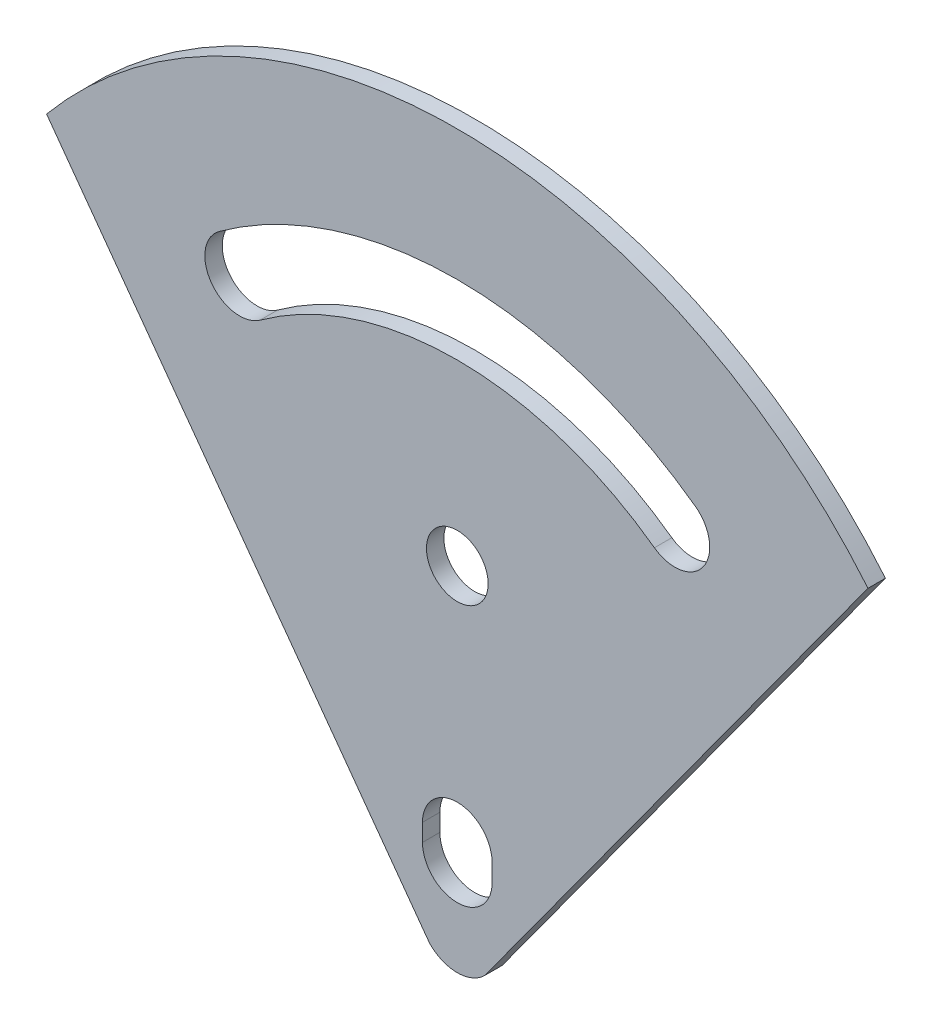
ISO-10303-21;
HEADER;
FILE_DESCRIPTION(('STEP AP214'),'2;1');
FILE_NAME('part.step','',(''),(''),'','','');
FILE_SCHEMA(('AUTOMOTIVE_DESIGN { 1 0 10303 214 1 1 1 1 }'));
ENDSEC;
DATA;
#1=APPLICATION_CONTEXT('core data for automotive mechanical design processes');
#2=APPLICATION_PROTOCOL_DEFINITION('international standard','automotive_design',2000,#1);
#3=PRODUCT_CONTEXT('',#1,'mechanical');
#4=PRODUCT('Part','Part','',(#3));
#5=PRODUCT_RELATED_PRODUCT_CATEGORY('part','',(#4));
#6=PRODUCT_DEFINITION_FORMATION('','',#4);
#7=PRODUCT_DEFINITION_CONTEXT('part definition',#1,'design');
#8=PRODUCT_DEFINITION('design','',#6,#7);
#9=PRODUCT_DEFINITION_SHAPE('','',#8);
#10=(LENGTH_UNIT() NAMED_UNIT(*) SI_UNIT(.MILLI.,.METRE.));
#11=(NAMED_UNIT(*) PLANE_ANGLE_UNIT() SI_UNIT($,.RADIAN.));
#12=(NAMED_UNIT(*) SI_UNIT($,.STERADIAN.) SOLID_ANGLE_UNIT());
#13=UNCERTAINTY_MEASURE_WITH_UNIT(LENGTH_MEASURE(1.E-05),#10,'distance_accuracy_value','');
#14=(GEOMETRIC_REPRESENTATION_CONTEXT(3) GLOBAL_UNCERTAINTY_ASSIGNED_CONTEXT((#13)) GLOBAL_UNIT_ASSIGNED_CONTEXT((#10,
#11,#12)) REPRESENTATION_CONTEXT('',''));
#15=CARTESIAN_POINT('',(0.,0.,0.));
#16=DIRECTION('',(0.,0.,1.));
#17=DIRECTION('',(1.,0.,0.));
#18=AXIS2_PLACEMENT_3D('',#15,#16,#17);
#19=CARTESIAN_POINT('',(-3.08558697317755E-13,32.545263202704,2.54));
#20=DIRECTION('',(0.,0.,-1.));
#21=DIRECTION('',(-1.,0.,0.));
#22=AXIS2_PLACEMENT_3D('',#19,#20,#21);
#23=PLANE('',#22);
#24=CARTESIAN_POINT('',(0.,55.245,2.54));
#25=DIRECTION('',(0.,0.,1.));
#26=DIRECTION('',(1.,0.,0.));
#27=AXIS2_PLACEMENT_3D('',#24,#25,#26);
#28=CIRCLE('',#27,4.5);
#29=CARTESIAN_POINT('',(4.5,55.245,2.54));
#30=VERTEX_POINT('',#29);
#31=EDGE_CURVE('E420',#30,#30,#28,.T.);
#32=ORIENTED_EDGE('',*,*,#31,.F.);
#33=EDGE_LOOP('',(#32));
#34=FACE_BOUND('',#33,.T.);
#35=CARTESIAN_POINT('',(0.,20.32,2.54));
#36=DIRECTION('',(0.,0.,1.));
#37=DIRECTION('',(1.,0.,0.));
#38=AXIS2_PLACEMENT_3D('',#35,#36,#37);
#39=CIRCLE('',#38,5.08);
#40=CARTESIAN_POINT('',(5.08,20.32,2.54));
#41=VERTEX_POINT('',#40);
#42=CARTESIAN_POINT('',(-5.08,20.32,2.54));
#43=VERTEX_POINT('',#42);
#44=EDGE_CURVE('E201',#41,#43,#39,.T.);
#45=ORIENTED_EDGE('',*,*,#44,.F.);
#46=DIRECTION('',(0.,1.,0.));
#47=VECTOR('',#46,1.);
#48=CARTESIAN_POINT('',(5.08,20.32,2.54));
#49=LINE('',#48,#47);
#50=CARTESIAN_POINT('',(5.08,17.78,2.54));
#51=VERTEX_POINT('',#50);
#52=EDGE_CURVE('E209',#51,#41,#49,.T.);
#53=ORIENTED_EDGE('',*,*,#52,.F.);
#54=CARTESIAN_POINT('',(0.,17.78,2.54));
#55=DIRECTION('',(0.,0.,1.));
#56=DIRECTION('',(1.,0.,0.));
#57=AXIS2_PLACEMENT_3D('',#54,#55,#56);
#58=CIRCLE('',#57,5.08);
#59=CARTESIAN_POINT('',(-5.08,17.78,2.54));
#60=VERTEX_POINT('',#59);
#61=EDGE_CURVE('E206',#60,#51,#58,.T.);
#62=ORIENTED_EDGE('',*,*,#61,.F.);
#63=DIRECTION('',(0.,-1.,0.));
#64=VECTOR('',#63,1.);
#65=CARTESIAN_POINT('',(-5.08,20.32,2.54));
#66=LINE('',#65,#64);
#67=EDGE_CURVE('E203',#43,#60,#66,.T.);
#68=ORIENTED_EDGE('',*,*,#67,.F.);
#69=EDGE_LOOP('',(#45,#53,#62,#68));
#70=FACE_BOUND('',#69,.T.);
#71=CARTESIAN_POINT('',(31.75,76.0393632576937,2.54));
#72=DIRECTION('',(0.,0.,1.));
#73=DIRECTION('',(1.,0.,0.));
#74=AXIS2_PLACEMENT_3D('',#71,#72,#73);
#75=CIRCLE('',#74,5.08);
#76=CARTESIAN_POINT('',(28.7630122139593,71.9303117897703,2.54));
#77=VERTEX_POINT('',#76);
#78=CARTESIAN_POINT('',(34.7369877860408,80.1484147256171,2.54));
#79=VERTEX_POINT('',#78);
#80=EDGE_CURVE('E175',#77,#79,#75,.T.);
#81=ORIENTED_EDGE('',*,*,#80,.F.);
#82=CARTESIAN_POINT('',(0.,32.3624574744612,2.54));
#83=DIRECTION('',(0.,0.,-1.));
#84=DIRECTION('',(1.,0.,0.));
#85=AXIS2_PLACEMENT_3D('',#82,#83,#84);
#86=CIRCLE('',#85,48.9175425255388);
#87=CARTESIAN_POINT('',(-28.7630122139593,71.9303117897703,2.54));
#88=VERTEX_POINT('',#87);
#89=EDGE_CURVE('E182',#88,#77,#86,.T.);
#90=ORIENTED_EDGE('',*,*,#89,.F.);
#91=CARTESIAN_POINT('',(-31.75,76.0393632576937,2.54));
#92=DIRECTION('',(0.,0.,1.));
#93=DIRECTION('',(1.,0.,0.));
#94=AXIS2_PLACEMENT_3D('',#91,#92,#93);
#95=CIRCLE('',#94,5.08);
#96=CARTESIAN_POINT('',(-34.7369877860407,80.1484147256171,2.54));
#97=VERTEX_POINT('',#96);
#98=EDGE_CURVE('E180',#97,#88,#95,.T.);
#99=ORIENTED_EDGE('',*,*,#98,.F.);
#100=CARTESIAN_POINT('',(0.,32.3624574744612,2.54));
#101=DIRECTION('',(0.,0.,1.));
#102=DIRECTION('',(1.,0.,0.));
#103=AXIS2_PLACEMENT_3D('',#100,#101,#102);
#104=CIRCLE('',#103,59.0775425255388);
#105=EDGE_CURVE('E177',#79,#97,#104,.T.);
#106=ORIENTED_EDGE('',*,*,#105,.F.);
#107=EDGE_LOOP('',(#81,#90,#99,#106));
#108=FACE_BOUND('',#107,.T.);
#109=DIRECTION('',(0.588203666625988,-0.808712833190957,0.));
#110=VECTOR('',#109,1.);
#111=CARTESIAN_POINT('',(0.,0.,2.54));
#112=LINE('',#111,#110);
#113=CARTESIAN_POINT('',(-59.9245165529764,82.3893632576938,2.54));
#114=VERTEX_POINT('',#113);
#115=CARTESIAN_POINT('',(-4.00687885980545,5.50900060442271,2.54));
#116=VERTEX_POINT('',#115);
#117=EDGE_CURVE('E138',#114,#116,#112,.T.);
#118=ORIENTED_EDGE('',*,*,#117,.T.);
#119=CARTESIAN_POINT('',(0.,9.51587946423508,2.54));
#120=DIRECTION('',(0.,0.,-1.));
#121=DIRECTION('',(-1.,0.,0.));
#122=AXIS2_PLACEMENT_3D('',#119,#120,#121);
#123=CIRCLE('',#122,5.66658242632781);
#124=CARTESIAN_POINT('',(4.00687885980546,5.50900060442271,2.54));
#125=VERTEX_POINT('',#124);
#126=EDGE_CURVE('E54',#125,#116,#123,.T.);
#127=ORIENTED_EDGE('',*,*,#126,.F.);
#128=DIRECTION('',(0.588203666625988,0.808712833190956,0.));
#129=VECTOR('',#128,1.);
#130=CARTESIAN_POINT('',(0.,0.,2.54));
#131=LINE('',#130,#129);
#132=CARTESIAN_POINT('',(59.9245165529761,82.3893632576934,2.54));
#133=VERTEX_POINT('',#132);
#134=EDGE_CURVE('E135',#125,#133,#131,.T.);
#135=ORIENTED_EDGE('',*,*,#134,.T.);
#136=CARTESIAN_POINT('',(-3.08558697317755E-13,32.545263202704,2.54));
#137=DIRECTION('',(0.,0.,1.));
#138=DIRECTION('',(-1.,0.,0.));
#139=AXIS2_PLACEMENT_3D('',#136,#137,#138);
#140=CIRCLE('',#139,77.9447367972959);
#141=EDGE_CURVE('E143',#133,#114,#140,.T.);
#142=ORIENTED_EDGE('',*,*,#141,.T.);
#143=EDGE_LOOP('',(#118,#127,#135,#142));
#144=FACE_BOUND('',#143,.T.);
#145=ADVANCED_FACE('F39',(#34,#70,#108,#144),#23,.F.);
#146=CARTESIAN_POINT('',(-3.08558697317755E-13,32.545263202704,0.));
#147=DIRECTION('',(0.,0.,-1.));
#148=DIRECTION('',(-1.,0.,0.));
#149=AXIS2_PLACEMENT_3D('',#146,#147,#148);
#150=PLANE('',#149);
#151=CARTESIAN_POINT('',(0.,55.245,0.));
#152=DIRECTION('',(0.,0.,1.));
#153=DIRECTION('',(1.,0.,0.));
#154=AXIS2_PLACEMENT_3D('',#151,#152,#153);
#155=CIRCLE('',#154,4.5);
#156=CARTESIAN_POINT('',(4.5,55.245,0.));
#157=VERTEX_POINT('',#156);
#158=EDGE_CURVE('E139',#157,#157,#155,.T.);
#159=ORIENTED_EDGE('',*,*,#158,.T.);
#160=EDGE_LOOP('',(#159));
#161=FACE_BOUND('',#160,.T.);
#162=CARTESIAN_POINT('',(0.,32.3624574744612,0.));
#163=DIRECTION('',(0.,0.,-1.));
#164=DIRECTION('',(1.,0.,0.));
#165=AXIS2_PLACEMENT_3D('',#162,#163,#164);
#166=CIRCLE('',#165,48.9175425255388);
#167=CARTESIAN_POINT('',(-28.7630122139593,71.9303117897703,0.));
#168=VERTEX_POINT('',#167);
#169=CARTESIAN_POINT('',(28.7630122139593,71.9303117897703,0.));
#170=VERTEX_POINT('',#169);
#171=EDGE_CURVE('E178',#168,#170,#166,.T.);
#172=ORIENTED_EDGE('',*,*,#171,.T.);
#173=CARTESIAN_POINT('',(31.75,76.0393632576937,0.));
#174=DIRECTION('',(0.,0.,1.));
#175=DIRECTION('',(1.,0.,0.));
#176=AXIS2_PLACEMENT_3D('',#173,#174,#175);
#177=CIRCLE('',#176,5.08);
#178=CARTESIAN_POINT('',(34.7369877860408,80.1484147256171,0.));
#179=VERTEX_POINT('',#178);
#180=EDGE_CURVE('E169',#170,#179,#177,.T.);
#181=ORIENTED_EDGE('',*,*,#180,.T.);
#182=CARTESIAN_POINT('',(0.,32.3624574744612,0.));
#183=DIRECTION('',(0.,0.,1.));
#184=DIRECTION('',(1.,0.,0.));
#185=AXIS2_PLACEMENT_3D('',#182,#183,#184);
#186=CIRCLE('',#185,59.0775425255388);
#187=CARTESIAN_POINT('',(-34.7369877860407,80.1484147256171,0.));
#188=VERTEX_POINT('',#187);
#189=EDGE_CURVE('E172',#179,#188,#186,.T.);
#190=ORIENTED_EDGE('',*,*,#189,.T.);
#191=CARTESIAN_POINT('',(-31.75,76.0393632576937,0.));
#192=DIRECTION('',(0.,0.,1.));
#193=DIRECTION('',(1.,0.,0.));
#194=AXIS2_PLACEMENT_3D('',#191,#192,#193);
#195=CIRCLE('',#194,5.08);
#196=EDGE_CURVE('E187',#188,#168,#195,.T.);
#197=ORIENTED_EDGE('',*,*,#196,.T.);
#198=EDGE_LOOP('',(#172,#181,#190,#197));
#199=FACE_BOUND('',#198,.T.);
#200=DIRECTION('',(0.,1.,0.));
#201=VECTOR('',#200,1.);
#202=CARTESIAN_POINT('',(5.08,20.32,0.));
#203=LINE('',#202,#201);
#204=CARTESIAN_POINT('',(5.08,17.78,0.));
#205=VERTEX_POINT('',#204);
#206=CARTESIAN_POINT('',(5.08,20.32,0.));
#207=VERTEX_POINT('',#206);
#208=EDGE_CURVE('E204',#205,#207,#203,.T.);
#209=ORIENTED_EDGE('',*,*,#208,.T.);
#210=CARTESIAN_POINT('',(0.,20.32,0.));
#211=DIRECTION('',(0.,0.,1.));
#212=DIRECTION('',(1.,0.,0.));
#213=AXIS2_PLACEMENT_3D('',#210,#211,#212);
#214=CIRCLE('',#213,5.08);
#215=CARTESIAN_POINT('',(-5.08,20.32,0.));
#216=VERTEX_POINT('',#215);
#217=EDGE_CURVE('E200',#207,#216,#214,.T.);
#218=ORIENTED_EDGE('',*,*,#217,.T.);
#219=DIRECTION('',(0.,-1.,0.));
#220=VECTOR('',#219,1.);
#221=CARTESIAN_POINT('',(-5.08,20.32,0.));
#222=LINE('',#221,#220);
#223=CARTESIAN_POINT('',(-5.08,17.78,0.));
#224=VERTEX_POINT('',#223);
#225=EDGE_CURVE('E214',#216,#224,#222,.T.);
#226=ORIENTED_EDGE('',*,*,#225,.T.);
#227=CARTESIAN_POINT('',(0.,17.78,0.));
#228=DIRECTION('',(0.,0.,1.));
#229=DIRECTION('',(1.,0.,0.));
#230=AXIS2_PLACEMENT_3D('',#227,#228,#229);
#231=CIRCLE('',#230,5.08);
#232=EDGE_CURVE('E217',#224,#205,#231,.T.);
#233=ORIENTED_EDGE('',*,*,#232,.T.);
#234=EDGE_LOOP('',(#209,#218,#226,#233));
#235=FACE_BOUND('',#234,.T.);
#236=CARTESIAN_POINT('',(0.,9.51587946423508,0.));
#237=DIRECTION('',(0.,0.,-1.));
#238=DIRECTION('',(-1.,0.,0.));
#239=AXIS2_PLACEMENT_3D('',#236,#237,#238);
#240=CIRCLE('',#239,5.66658242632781);
#241=CARTESIAN_POINT('',(-4.00687885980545,5.5090006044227,0.));
#242=VERTEX_POINT('',#241);
#243=CARTESIAN_POINT('',(4.00687885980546,5.50900060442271,0.));
#244=VERTEX_POINT('',#243);
#245=EDGE_CURVE('E128',#242,#244,#240,.F.);
#246=ORIENTED_EDGE('',*,*,#245,.F.);
#247=DIRECTION('',(0.588203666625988,-0.808712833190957,0.));
#248=VECTOR('',#247,1.);
#249=CARTESIAN_POINT('',(0.,0.,0.));
#250=LINE('',#249,#248);
#251=CARTESIAN_POINT('',(-59.9245165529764,82.3893632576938,0.));
#252=VERTEX_POINT('',#251);
#253=EDGE_CURVE('E144',#252,#242,#250,.T.);
#254=ORIENTED_EDGE('',*,*,#253,.F.);
#255=CARTESIAN_POINT('',(-3.08558697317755E-13,32.545263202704,0.));
#256=DIRECTION('',(0.,0.,1.));
#257=DIRECTION('',(-1.,0.,0.));
#258=AXIS2_PLACEMENT_3D('',#255,#256,#257);
#259=CIRCLE('',#258,77.9447367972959);
#260=CARTESIAN_POINT('',(59.9245165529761,82.3893632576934,0.));
#261=VERTEX_POINT('',#260);
#262=EDGE_CURVE('E148',#261,#252,#259,.T.);
#263=ORIENTED_EDGE('',*,*,#262,.F.);
#264=DIRECTION('',(0.588203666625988,0.808712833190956,0.));
#265=VECTOR('',#264,1.);
#266=CARTESIAN_POINT('',(0.,0.,0.));
#267=LINE('',#266,#265);
#268=EDGE_CURVE('E156',#244,#261,#267,.T.);
#269=ORIENTED_EDGE('',*,*,#268,.F.);
#270=EDGE_LOOP('',(#246,#254,#263,#269));
#271=FACE_BOUND('',#270,.T.);
#272=ADVANCED_FACE('F168',(#161,#199,#235,#271),#150,.T.);
#273=CARTESIAN_POINT('',(0.,0.,2.54));
#274=DIRECTION('',(-0.808712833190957,0.588203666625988,0.));
#275=DIRECTION('',(-0.588203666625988,-0.808712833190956,0.));
#276=AXIS2_PLACEMENT_3D('',#273,#274,#275);
#277=PLANE('',#276);
#278=ORIENTED_EDGE('',*,*,#134,.F.);
#279=DIRECTION('',(0.,0.,1.));
#280=VECTOR('',#279,1.);
#281=CARTESIAN_POINT('',(4.00687885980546,5.50900060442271,-2.54));
#282=LINE('',#281,#280);
#283=EDGE_CURVE('E125',#244,#125,#282,.T.);
#284=ORIENTED_EDGE('',*,*,#283,.F.);
#285=ORIENTED_EDGE('',*,*,#268,.T.);
#286=DIRECTION('',(0.,0.,-1.));
#287=VECTOR('',#286,1.);
#288=CARTESIAN_POINT('',(59.9245165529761,82.3893632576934,2.54));
#289=LINE('',#288,#287);
#290=EDGE_CURVE('E47',#133,#261,#289,.T.);
#291=ORIENTED_EDGE('',*,*,#290,.F.);
#292=EDGE_LOOP('',(#278,#284,#285,#291));
#293=FACE_BOUND('',#292,.T.);
#294=ADVANCED_FACE('F41',(#293),#277,.F.);
#295=CARTESIAN_POINT('',(-3.08558697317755E-13,32.545263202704,2.54));
#296=DIRECTION('',(0.,0.,-1.));
#297=DIRECTION('',(-1.,0.,0.));
#298=AXIS2_PLACEMENT_3D('',#295,#296,#297);
#299=CYLINDRICAL_SURFACE('',#298,77.9447367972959);
#300=ORIENTED_EDGE('',*,*,#262,.T.);
#301=DIRECTION('',(0.,0.,-1.));
#302=VECTOR('',#301,1.);
#303=CARTESIAN_POINT('',(-59.9245165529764,82.3893632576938,2.54));
#304=LINE('',#303,#302);
#305=EDGE_CURVE('E155',#114,#252,#304,.T.);
#306=ORIENTED_EDGE('',*,*,#305,.F.);
#307=ORIENTED_EDGE('',*,*,#141,.F.);
#308=ORIENTED_EDGE('',*,*,#290,.T.);
#309=EDGE_LOOP('',(#300,#306,#307,#308));
#310=FACE_BOUND('',#309,.T.);
#311=ADVANCED_FACE('F161',(#310),#299,.T.);
#312=CARTESIAN_POINT('',(0.,0.,2.54));
#313=DIRECTION('',(0.808712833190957,0.588203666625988,0.));
#314=DIRECTION('',(-0.588203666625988,0.808712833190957,0.));
#315=AXIS2_PLACEMENT_3D('',#312,#313,#314);
#316=PLANE('',#315);
#317=ORIENTED_EDGE('',*,*,#253,.T.);
#318=DIRECTION('',(0.,0.,1.));
#319=VECTOR('',#318,1.);
#320=CARTESIAN_POINT('',(-4.00687885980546,5.50900060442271,-2.54));
#321=LINE('',#320,#319);
#322=EDGE_CURVE('E11',#242,#116,#321,.T.);
#323=ORIENTED_EDGE('',*,*,#322,.T.);
#324=ORIENTED_EDGE('',*,*,#117,.F.);
#325=ORIENTED_EDGE('',*,*,#305,.T.);
#326=EDGE_LOOP('',(#317,#323,#324,#325));
#327=FACE_BOUND('',#326,.T.);
#328=ADVANCED_FACE('F166',(#327),#316,.F.);
#329=CARTESIAN_POINT('',(0.,20.32,2.54));
#330=DIRECTION('',(0.,0.,-1.));
#331=DIRECTION('',(-1.,0.,0.));
#332=AXIS2_PLACEMENT_3D('',#329,#330,#331);
#333=CYLINDRICAL_SURFACE('',#332,5.08);
#334=ORIENTED_EDGE('',*,*,#217,.F.);
#335=DIRECTION('',(0.,0.,-1.));
#336=VECTOR('',#335,1.);
#337=CARTESIAN_POINT('',(5.08,20.32,2.54));
#338=LINE('',#337,#336);
#339=EDGE_CURVE('E211',#41,#207,#338,.T.);
#340=ORIENTED_EDGE('',*,*,#339,.F.);
#341=ORIENTED_EDGE('',*,*,#44,.T.);
#342=DIRECTION('',(0.,0.,-1.));
#343=VECTOR('',#342,1.);
#344=CARTESIAN_POINT('',(-5.08,20.32,2.54));
#345=LINE('',#344,#343);
#346=EDGE_CURVE('E151',#43,#216,#345,.T.);
#347=ORIENTED_EDGE('',*,*,#346,.T.);
#348=EDGE_LOOP('',(#334,#340,#341,#347));
#349=FACE_BOUND('',#348,.T.);
#350=ADVANCED_FACE('F232',(#349),#333,.F.);
#351=CARTESIAN_POINT('',(-5.08,20.32,2.54));
#352=DIRECTION('',(1.,0.,0.));
#353=DIRECTION('',(0.,0.,-1.));
#354=AXIS2_PLACEMENT_3D('',#351,#352,#353);
#355=PLANE('',#354);
#356=ORIENTED_EDGE('',*,*,#225,.F.);
#357=ORIENTED_EDGE('',*,*,#346,.F.);
#358=ORIENTED_EDGE('',*,*,#67,.T.);
#359=DIRECTION('',(0.,0.,-1.));
#360=VECTOR('',#359,1.);
#361=CARTESIAN_POINT('',(-5.08,17.78,2.54));
#362=LINE('',#361,#360);
#363=EDGE_CURVE('E225',#60,#224,#362,.T.);
#364=ORIENTED_EDGE('',*,*,#363,.T.);
#365=EDGE_LOOP('',(#356,#357,#358,#364));
#366=FACE_BOUND('',#365,.T.);
#367=ADVANCED_FACE('F244',(#366),#355,.T.);
#368=CARTESIAN_POINT('',(0.,17.78,2.54));
#369=DIRECTION('',(0.,0.,-1.));
#370=DIRECTION('',(-1.,0.,0.));
#371=AXIS2_PLACEMENT_3D('',#368,#369,#370);
#372=CYLINDRICAL_SURFACE('',#371,5.08);
#373=ORIENTED_EDGE('',*,*,#232,.F.);
#374=ORIENTED_EDGE('',*,*,#363,.F.);
#375=ORIENTED_EDGE('',*,*,#61,.T.);
#376=DIRECTION('',(0.,0.,-1.));
#377=VECTOR('',#376,1.);
#378=CARTESIAN_POINT('',(5.08,17.78,2.54));
#379=LINE('',#378,#377);
#380=EDGE_CURVE('E224',#51,#205,#379,.T.);
#381=ORIENTED_EDGE('',*,*,#380,.T.);
#382=EDGE_LOOP('',(#373,#374,#375,#381));
#383=FACE_BOUND('',#382,.T.);
#384=ADVANCED_FACE('F246',(#383),#372,.F.);
#385=CARTESIAN_POINT('',(5.08,20.32,2.54));
#386=DIRECTION('',(-1.,0.,0.));
#387=DIRECTION('',(0.,0.,1.));
#388=AXIS2_PLACEMENT_3D('',#385,#386,#387);
#389=PLANE('',#388);
#390=ORIENTED_EDGE('',*,*,#208,.F.);
#391=ORIENTED_EDGE('',*,*,#380,.F.);
#392=ORIENTED_EDGE('',*,*,#52,.T.);
#393=ORIENTED_EDGE('',*,*,#339,.T.);
#394=EDGE_LOOP('',(#390,#391,#392,#393));
#395=FACE_BOUND('',#394,.T.);
#396=ADVANCED_FACE('F239',(#395),#389,.T.);
#397=CARTESIAN_POINT('',(31.75,76.0393632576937,2.54));
#398=DIRECTION('',(0.,0.,-1.));
#399=DIRECTION('',(-1.,0.,0.));
#400=AXIS2_PLACEMENT_3D('',#397,#398,#399);
#401=CYLINDRICAL_SURFACE('',#400,5.08);
#402=ORIENTED_EDGE('',*,*,#180,.F.);
#403=DIRECTION('',(0.,0.,-1.));
#404=VECTOR('',#403,1.);
#405=CARTESIAN_POINT('',(28.7630122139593,71.9303117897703,2.54));
#406=LINE('',#405,#404);
#407=EDGE_CURVE('E183',#77,#170,#406,.T.);
#408=ORIENTED_EDGE('',*,*,#407,.F.);
#409=ORIENTED_EDGE('',*,*,#80,.T.);
#410=DIRECTION('',(0.,0.,-1.));
#411=VECTOR('',#410,1.);
#412=CARTESIAN_POINT('',(34.7369877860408,80.1484147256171,2.54));
#413=LINE('',#412,#411);
#414=EDGE_CURVE('E197',#79,#179,#413,.T.);
#415=ORIENTED_EDGE('',*,*,#414,.T.);
#416=EDGE_LOOP('',(#402,#408,#409,#415));
#417=FACE_BOUND('',#416,.T.);
#418=ADVANCED_FACE('F253',(#417),#401,.F.);
#419=CARTESIAN_POINT('',(0.,32.3624574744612,2.54));
#420=DIRECTION('',(0.,0.,-1.));
#421=DIRECTION('',(-1.,0.,0.));
#422=AXIS2_PLACEMENT_3D('',#419,#420,#421);
#423=CYLINDRICAL_SURFACE('',#422,59.0775425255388);
#424=ORIENTED_EDGE('',*,*,#189,.F.);
#425=ORIENTED_EDGE('',*,*,#414,.F.);
#426=ORIENTED_EDGE('',*,*,#105,.T.);
#427=DIRECTION('',(0.,0.,-1.));
#428=VECTOR('',#427,1.);
#429=CARTESIAN_POINT('',(-34.7369877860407,80.1484147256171,2.54));
#430=LINE('',#429,#428);
#431=EDGE_CURVE('E195',#97,#188,#430,.T.);
#432=ORIENTED_EDGE('',*,*,#431,.T.);
#433=EDGE_LOOP('',(#424,#425,#426,#432));
#434=FACE_BOUND('',#433,.T.);
#435=ADVANCED_FACE('F315',(#434),#423,.F.);
#436=CARTESIAN_POINT('',(-31.75,76.0393632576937,2.54));
#437=DIRECTION('',(0.,0.,-1.));
#438=DIRECTION('',(-1.,0.,0.));
#439=AXIS2_PLACEMENT_3D('',#436,#437,#438);
#440=CYLINDRICAL_SURFACE('',#439,5.08);
#441=ORIENTED_EDGE('',*,*,#196,.F.);
#442=ORIENTED_EDGE('',*,*,#431,.F.);
#443=ORIENTED_EDGE('',*,*,#98,.T.);
#444=DIRECTION('',(0.,0.,-1.));
#445=VECTOR('',#444,1.);
#446=CARTESIAN_POINT('',(-28.7630122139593,71.9303117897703,2.54));
#447=LINE('',#446,#445);
#448=EDGE_CURVE('E61',#88,#168,#447,.T.);
#449=ORIENTED_EDGE('',*,*,#448,.T.);
#450=EDGE_LOOP('',(#441,#442,#443,#449));
#451=FACE_BOUND('',#450,.T.);
#452=ADVANCED_FACE('F308',(#451),#440,.F.);
#453=CARTESIAN_POINT('',(0.,32.3624574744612,2.54));
#454=DIRECTION('',(0.,0.,-1.));
#455=DIRECTION('',(-1.,0.,0.));
#456=AXIS2_PLACEMENT_3D('',#453,#454,#455);
#457=CYLINDRICAL_SURFACE('',#456,48.9175425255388);
#458=ORIENTED_EDGE('',*,*,#171,.F.);
#459=ORIENTED_EDGE('',*,*,#448,.F.);
#460=ORIENTED_EDGE('',*,*,#89,.T.);
#461=ORIENTED_EDGE('',*,*,#407,.T.);
#462=EDGE_LOOP('',(#458,#459,#460,#461));
#463=FACE_BOUND('',#462,.T.);
#464=ADVANCED_FACE('F303',(#463),#457,.T.);
#465=CARTESIAN_POINT('',(0.,9.51587946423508,-2.54));
#466=DIRECTION('',(0.,0.,1.));
#467=DIRECTION('',(1.,0.,0.));
#468=AXIS2_PLACEMENT_3D('',#465,#466,#467);
#469=CYLINDRICAL_SURFACE('',#468,5.66658242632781);
#470=ORIENTED_EDGE('',*,*,#245,.T.);
#471=ORIENTED_EDGE('',*,*,#283,.T.);
#472=ORIENTED_EDGE('',*,*,#126,.T.);
#473=ORIENTED_EDGE('',*,*,#322,.F.);
#474=EDGE_LOOP('',(#470,#471,#472,#473));
#475=FACE_BOUND('',#474,.T.);
#476=ADVANCED_FACE('F126',(#475),#469,.T.);
#477=CARTESIAN_POINT('',(0.,55.245,2.54));
#478=DIRECTION('',(0.,0.,1.));
#479=DIRECTION('',(1.,0.,0.));
#480=AXIS2_PLACEMENT_3D('',#477,#478,#479);
#481=CYLINDRICAL_SURFACE('',#480,4.5);
#482=ORIENTED_EDGE('',*,*,#158,.F.);
#483=EDGE_LOOP('',(#482));
#484=FACE_BOUND('',#483,.T.);
#485=ORIENTED_EDGE('',*,*,#31,.T.);
#486=EDGE_LOOP('',(#485));
#487=FACE_BOUND('',#486,.T.);
#488=ADVANCED_FACE('F289',(#484,#487),#481,.F.);
#489=CLOSED_SHELL('',(#145,#272,#294,#311,#328,#350,#367,#384,#396,#418,#435,#452,#464,#476,#488));
#490=MANIFOLD_SOLID_BREP('B2',#489);
#491=ADVANCED_BREP_SHAPE_REPRESENTATION('',(#18,#490),#14);
#492=SHAPE_DEFINITION_REPRESENTATION(#9,#491);
ENDSEC;
END-ISO-10303-21;
